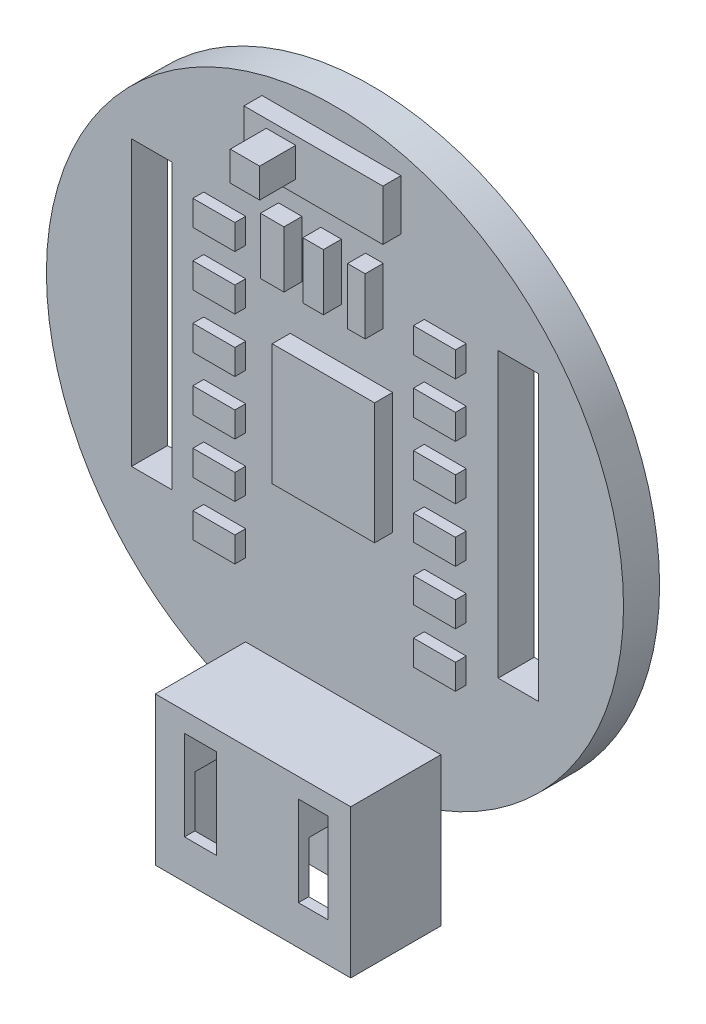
from build123d import *

# Parameters (mm, degrees)
SKETCH_1_R          = 1.6
EXTRUDE_1_DEPTH     = 0.2
SKETCH_2_W          = 0.223470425
SKETCH_2_H          = 1.573604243
CUT_EXTRUDE_1_DEPTH = 0.2
SKETCH_3_W          = 0.232781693
SKETCH_3_H          = 0.139669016
EXTRUDE_2_DEPTH     = 0.06
SKETCH_4_W          = 0.567820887
SKETCH_4_H          = 0.672247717
SKETCH_4_W_2        = 0.130533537
SKETCH_4_H_2        = 0.313280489
SKETCH_4_W_3        = 0.114216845
SKETCH_4_W_4        = 0.097900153
SKETCH_4_W_5        = 0.77014787
SKETCH_4_H_3        = 0.280647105
EXTRUDE_3_DEPTH     = 0.1
SKETCH_5_W          = 0.163166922
SKETCH_5_H          = 0.163166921
EXTRUDE_4_DEPTH     = 0.3
SKETCH_6_W          = 1.083428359
SKETCH_6_H          = 0.822361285
EXTRUDE_5_DEPTH     = 0.5
SKETCH_7_W          = 0.17831778
SKETCH_7_H          = 0.497803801
SKETCH_7_W_2        = 0.163457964
CUT_EXTRUDE_2_DEPTH = 0.3
SKETCH_8_W          = 0.927974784
SKETCH_8_H          = 0.373207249
CUT_EXTRUDE_3_DEPTH = 0.5


with BuildPart() as part:
    # Sketch 1 → Extrude 1 (new body)
    with BuildSketch(Plane.XY):
        with Locations((-18.657718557, 41.110000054)):
            Circle(SKETCH_1_R)
    extrude(amount=EXTRUDE_1_DEPTH)

    # Sketch 2 → Cut-Extrude 1 (cut)
    with BuildSketch(Plane.XY.offset(0.2)):
        with Locations((-19.67421764, 41.202569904)):
            Rectangle(SKETCH_2_W, SKETCH_2_H)
        with Locations((-17.641219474, 41.202569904)):
            Rectangle(SKETCH_2_W, SKETCH_2_H)
    extrude(amount=-CUT_EXTRUDE_1_DEPTH, mode=Mode.SUBTRACT)

    # Sketch 3 → Extrude 2 (add)
    with BuildSketch(Plane.XY.offset(0.2)):
        with Locations((-19.269177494, 41.563669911)):
            Rectangle(SKETCH_3_W, SKETCH_3_H)
        with Locations((-19.269177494, 41.863669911)):
            Rectangle(SKETCH_3_W, SKETCH_3_H)
        with Locations((-19.269177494, 41.263669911)):
            Rectangle(SKETCH_3_W, SKETCH_3_H)
        with Locations((-19.269177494, 40.963669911)):
            Rectangle(SKETCH_3_W, SKETCH_3_H)
        with Locations((-19.269177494, 40.663669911)):
            Rectangle(SKETCH_3_W, SKETCH_3_H)
        with Locations((-19.269177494, 40.363669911)):
            Rectangle(SKETCH_3_W, SKETCH_3_H)
        with Locations((-18.04625962, 40.363669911)):
            Rectangle(SKETCH_3_W, SKETCH_3_H)
        with Locations((-18.04625962, 40.663669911)):
            Rectangle(SKETCH_3_W, SKETCH_3_H)
        with Locations((-18.04625962, 40.963669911)):
            Rectangle(SKETCH_3_W, SKETCH_3_H)
        with Locations((-18.04625962, 41.263669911)):
            Rectangle(SKETCH_3_W, SKETCH_3_H)
        with Locations((-18.04625962, 41.563669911)):
            Rectangle(SKETCH_3_W, SKETCH_3_H)
        with Locations((-18.04625962, 41.863669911)):
            Rectangle(SKETCH_3_W, SKETCH_3_H)
    extrude(amount=EXTRUDE_2_DEPTH)

    # Sketch 4 → Extrude 3 (add)
    with BuildSketch(Plane.XY.offset(0.2)):
        with Locations((-18.621821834, 41.158950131)):
            Rectangle(SKETCH_4_W, SKETCH_4_H)
        with Locations((-18.905732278, 41.93236134)):
            Rectangle(SKETCH_4_W_2, SKETCH_4_H_2)
        with Locations((-18.678930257, 41.93236134)):
            Rectangle(SKETCH_4_W_3, SKETCH_4_H_2)
        with Locations((-18.439074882, 41.93236134)):
            Rectangle(SKETCH_4_W_4, SKETCH_4_H_2)
        with Locations((-18.677298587, 42.418598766)):
            Rectangle(SKETCH_4_W_5, SKETCH_4_H_3)
    extrude(amount=EXTRUDE_3_DEPTH)

    # Sketch 5 → Extrude 4 (add)
    with BuildSketch(Plane.XY.offset(0.2)):
        with Locations((-18.856782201, 42.43165212)):
            Rectangle(SKETCH_5_W, SKETCH_5_H)
    extrude(amount=EXTRUDE_4_DEPTH)

    # Sketch 6 → Extrude 5 (add)
    with BuildSketch(Plane.XY.offset(0.2)):
        with Locations((-18.612031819, 39.478330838)):
            Rectangle(SKETCH_6_W, SKETCH_6_H)
    extrude(amount=EXTRUDE_5_DEPTH)

    # Sketch 7 → Cut-Extrude 2 (cut)
    with BuildSketch(Plane.XY.offset(0.7)):
        with Locations((-18.902905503, 39.532617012)):
            Rectangle(SKETCH_7_W, SKETCH_7_H)
        with Locations((-18.278793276, 39.532617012)):
            Rectangle(SKETCH_7_W_2, SKETCH_7_H)
    extrude(amount=-CUT_EXTRUDE_2_DEPTH, mode=Mode.SUBTRACT)

    # Sketch 8 → Cut-Extrude 3 (cut)
    with BuildSketch(Plane.XZ.offset(-39.067150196)):
        with Locations((-18.597198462, 0.455910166)):
            Rectangle(SKETCH_8_W, SKETCH_8_H)
    extrude(amount=-CUT_EXTRUDE_3_DEPTH, mode=Mode.SUBTRACT)


solid = part.part
